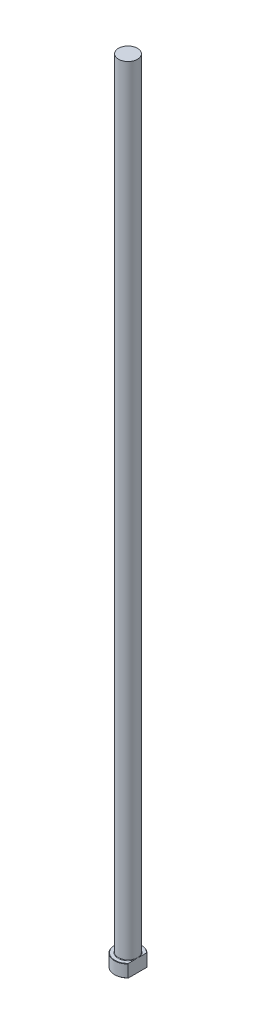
ISO-10303-21;
HEADER;
FILE_DESCRIPTION(('STEP AP214'),'2;1');
FILE_NAME('part.step','',(''),(''),'','','');
FILE_SCHEMA(('AUTOMOTIVE_DESIGN { 1 0 10303 214 1 1 1 1 }'));
ENDSEC;
DATA;
#1=APPLICATION_CONTEXT('core data for automotive mechanical design processes');
#2=APPLICATION_PROTOCOL_DEFINITION('international standard','automotive_design',2000,#1);
#3=PRODUCT_CONTEXT('',#1,'mechanical');
#4=PRODUCT('Part','Part','',(#3));
#5=PRODUCT_RELATED_PRODUCT_CATEGORY('part','',(#4));
#6=PRODUCT_DEFINITION_FORMATION('','',#4);
#7=PRODUCT_DEFINITION_CONTEXT('part definition',#1,'design');
#8=PRODUCT_DEFINITION('design','',#6,#7);
#9=PRODUCT_DEFINITION_SHAPE('','',#8);
#10=(LENGTH_UNIT() NAMED_UNIT(*) SI_UNIT(.MILLI.,.METRE.));
#11=(NAMED_UNIT(*) PLANE_ANGLE_UNIT() SI_UNIT($,.RADIAN.));
#12=(NAMED_UNIT(*) SI_UNIT($,.STERADIAN.) SOLID_ANGLE_UNIT());
#13=UNCERTAINTY_MEASURE_WITH_UNIT(LENGTH_MEASURE(1.E-05),#10,'distance_accuracy_value','');
#14=(GEOMETRIC_REPRESENTATION_CONTEXT(3) GLOBAL_UNCERTAINTY_ASSIGNED_CONTEXT((#13)) GLOBAL_UNIT_ASSIGNED_CONTEXT((#10,
#11,#12)) REPRESENTATION_CONTEXT('',''));
#15=CARTESIAN_POINT('',(0.,0.,0.));
#16=DIRECTION('',(0.,0.,1.));
#17=DIRECTION('',(1.,0.,0.));
#18=AXIS2_PLACEMENT_3D('',#15,#16,#17);
#19=CARTESIAN_POINT('',(0.,0.,0.));
#20=DIRECTION('',(0.,-1.,0.));
#21=DIRECTION('',(0.,0.,-1.));
#22=AXIS2_PLACEMENT_3D('',#19,#20,#21);
#23=PLANE('',#22);
#24=CARTESIAN_POINT('',(0.,0.,0.));
#25=DIRECTION('',(0.,-1.,0.));
#26=DIRECTION('',(0.,0.,-1.));
#27=AXIS2_PLACEMENT_3D('',#24,#25,#26);
#28=CIRCLE('',#27,8.29999999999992);
#29=CARTESIAN_POINT('',(5.99999999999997,0.,5.73498038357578));
#30=VERTEX_POINT('',#29);
#31=CARTESIAN_POINT('',(5.99999999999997,0.,-5.73498038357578));
#32=VERTEX_POINT('',#31);
#33=EDGE_CURVE('E98',#30,#32,#28,.T.);
#34=ORIENTED_EDGE('',*,*,#33,.T.);
#35=DIRECTION('',(0.,0.,1.));
#36=VECTOR('',#35,1.);
#37=CARTESIAN_POINT('',(5.99999999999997,0.,6.02079728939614));
#38=LINE('',#37,#36);
#39=EDGE_CURVE('E83',#32,#30,#38,.T.);
#40=ORIENTED_EDGE('',*,*,#39,.T.);
#41=EDGE_LOOP('',(#34,#40));
#42=FACE_BOUND('',#41,.T.);
#43=ADVANCED_FACE('F32',(#42),#23,.T.);
#44=CARTESIAN_POINT('',(0.,259.958771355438,0.));
#45=DIRECTION('',(0.,1.,0.));
#46=DIRECTION('',(0.,0.,1.));
#47=AXIS2_PLACEMENT_3D('',#44,#45,#46);
#48=CYLINDRICAL_SURFACE('',#47,8.49999999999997);
#49=CARTESIAN_POINT('',(0.,7.80000000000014,0.));
#50=DIRECTION('',(0.,1.,0.));
#51=DIRECTION('',(0.,0.,1.));
#52=AXIS2_PLACEMENT_3D('',#49,#50,#51);
#53=CIRCLE('',#52,8.49999999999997);
#54=CARTESIAN_POINT('',(5.99999999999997,7.80000000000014,6.02079728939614));
#55=VERTEX_POINT('',#54);
#56=CARTESIAN_POINT('',(5.99999999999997,7.80000000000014,-6.02079728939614));
#57=VERTEX_POINT('',#56);
#58=EDGE_CURVE('E104',#55,#57,#53,.F.);
#59=ORIENTED_EDGE('',*,*,#58,.T.);
#60=DIRECTION('',(0.,-1.,0.));
#61=VECTOR('',#60,1.);
#62=CARTESIAN_POINT('',(5.99999999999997,500.,-6.02079728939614));
#63=LINE('',#62,#61);
#64=CARTESIAN_POINT('',(5.99999999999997,0.200000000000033,-6.02079728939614));
#65=VERTEX_POINT('',#64);
#66=EDGE_CURVE('E183',#57,#65,#63,.T.);
#67=ORIENTED_EDGE('',*,*,#66,.T.);
#68=CARTESIAN_POINT('',(0.,0.200000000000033,0.));
#69=DIRECTION('',(0.,-1.,0.));
#70=DIRECTION('',(0.,0.,-1.));
#71=AXIS2_PLACEMENT_3D('',#68,#69,#70);
#72=CIRCLE('',#71,8.49999999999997);
#73=CARTESIAN_POINT('',(5.99999999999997,0.200000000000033,6.02079728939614));
#74=VERTEX_POINT('',#73);
#75=EDGE_CURVE('E100',#65,#74,#72,.F.);
#76=ORIENTED_EDGE('',*,*,#75,.T.);
#77=DIRECTION('',(0.,-1.,0.));
#78=VECTOR('',#77,1.);
#79=CARTESIAN_POINT('',(5.99999999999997,500.,6.02079728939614));
#80=LINE('',#79,#78);
#81=EDGE_CURVE('E93',#55,#74,#80,.T.);
#82=ORIENTED_EDGE('',*,*,#81,.F.);
#83=EDGE_LOOP('',(#59,#67,#76,#82));
#84=FACE_BOUND('',#83,.T.);
#85=ADVANCED_FACE('F158',(#84),#48,.T.);
#86=CARTESIAN_POINT('',(-8.49999999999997,8.,0.));
#87=DIRECTION('',(0.,1.,0.));
#88=DIRECTION('',(0.,0.,1.));
#89=AXIS2_PLACEMENT_3D('',#86,#87,#88);
#90=PLANE('',#89);
#91=CARTESIAN_POINT('',(0.,8.,0.));
#92=DIRECTION('',(0.,1.,0.));
#93=DIRECTION('',(0.,0.,1.));
#94=AXIS2_PLACEMENT_3D('',#91,#92,#93);
#95=CIRCLE('',#94,8.30000000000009);
#96=CARTESIAN_POINT('',(5.99999999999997,8.,-5.73498038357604));
#97=VERTEX_POINT('',#96);
#98=CARTESIAN_POINT('',(5.99999999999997,8.,5.73498038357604));
#99=VERTEX_POINT('',#98);
#100=EDGE_CURVE('E178',#97,#99,#95,.T.);
#101=ORIENTED_EDGE('',*,*,#100,.T.);
#102=DIRECTION('',(0.,0.,-1.));
#103=VECTOR('',#102,1.);
#104=CARTESIAN_POINT('',(5.99999999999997,8.,0.));
#105=LINE('',#104,#103);
#106=CARTESIAN_POINT('',(5.99999999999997,7.99999999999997,1.92093727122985));
#107=VERTEX_POINT('',#106);
#108=EDGE_CURVE('E57',#99,#107,#105,.T.);
#109=ORIENTED_EDGE('',*,*,#108,.T.);
#110=CARTESIAN_POINT('',(0.,8.,0.));
#111=DIRECTION('',(0.,1.,0.));
#112=DIRECTION('',(0.,0.,1.));
#113=AXIS2_PLACEMENT_3D('',#110,#111,#112);
#114=CIRCLE('',#113,6.29999999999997);
#115=CARTESIAN_POINT('',(5.99999999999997,7.99999999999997,-1.92093727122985));
#116=VERTEX_POINT('',#115);
#117=EDGE_CURVE('E107',#107,#116,#114,.F.);
#118=ORIENTED_EDGE('',*,*,#117,.T.);
#119=EDGE_CURVE('E136',#116,#97,#105,.T.);
#120=ORIENTED_EDGE('',*,*,#119,.T.);
#121=EDGE_LOOP('',(#101,#109,#118,#120));
#122=FACE_BOUND('',#121,.T.);
#123=ADVANCED_FACE('F147',(#122),#90,.T.);
#124=CARTESIAN_POINT('',(0.,8.00000000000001,0.));
#125=DIRECTION('',(0.,-1.,0.));
#126=DIRECTION('',(0.,0.,-1.));
#127=AXIS2_PLACEMENT_3D('',#124,#125,#126);
#128=CONICAL_SURFACE('',#127,8.30000000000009,0.785398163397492);
#129=ORIENTED_EDGE('',*,*,#58,.F.);
#130=CARTESIAN_POINT('',(5.99999999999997,1.75758968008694,13.2469505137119));
#131=CARTESIAN_POINT('',(5.99999999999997,1.93438223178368,13.0528651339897));
#132=CARTESIAN_POINT('',(5.99999999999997,2.1108173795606,12.8584542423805));
#133=CARTESIAN_POINT('',(5.99999999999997,2.46286810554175,12.4688887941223));
#134=CARTESIAN_POINT('',(5.99999999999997,2.63848367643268,12.2737342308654));
#135=CARTESIAN_POINT('',(5.99999999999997,3.16402789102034,11.6869221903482));
#136=CARTESIAN_POINT('',(5.99999999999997,3.512564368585,11.2940145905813));
#137=CARTESIAN_POINT('',(5.99999999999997,4.20737297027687,10.5008820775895));
#138=CARTESIAN_POINT('',(5.99999999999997,4.55360756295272,10.1006242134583));
#139=CARTESIAN_POINT('',(5.99999999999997,5.23924501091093,9.29437446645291));
#140=CARTESIAN_POINT('',(5.99999999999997,5.57864880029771,8.88838338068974));
#141=CARTESIAN_POINT('',(5.99999999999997,6.20014365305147,8.12701556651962));
#142=CARTESIAN_POINT('',(5.99999999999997,6.48350363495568,7.77268056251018));
#143=CARTESIAN_POINT('',(5.99999999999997,6.90118479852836,7.23535305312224));
#144=CARTESIAN_POINT('',(5.99999999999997,7.03920968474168,7.05523994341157));
#145=CARTESIAN_POINT('',(5.99999999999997,7.31228512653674,6.69277597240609));
#146=CARTESIAN_POINT('',(5.99999999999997,7.44733576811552,6.51042517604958));
#147=CARTESIAN_POINT('',(5.99999999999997,7.71365491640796,6.14339029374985));
#148=CARTESIAN_POINT('',(5.99999999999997,7.84492875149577,5.95871008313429));
#149=CARTESIAN_POINT('',(5.99999999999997,8.1031071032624,5.58632824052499));
#150=CARTESIAN_POINT('',(5.99999999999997,8.23001189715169,5.3986268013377));
#151=CARTESIAN_POINT('',(5.99999999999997,8.47838103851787,5.01977879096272));
#152=CARTESIAN_POINT('',(5.99999999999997,8.59984807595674,4.82863399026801));
#153=CARTESIAN_POINT('',(5.99999999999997,8.83606873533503,4.44225695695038));
#154=CARTESIAN_POINT('',(5.99999999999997,8.95082335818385,4.24702533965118));
#155=CARTESIAN_POINT('',(5.99999999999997,9.16834438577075,3.85819092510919));
#156=CARTESIAN_POINT('',(5.99999999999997,9.27137801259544,3.66473854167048));
#157=CARTESIAN_POINT('',(5.99999999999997,9.467540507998,3.27281000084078));
#158=CARTESIAN_POINT('',(5.99999999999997,9.56066848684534,3.07433339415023));
#159=CARTESIAN_POINT('',(5.99999999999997,9.73431152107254,2.67227927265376));
#160=CARTESIAN_POINT('',(5.99999999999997,9.81484758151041,2.46871092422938));
#161=CARTESIAN_POINT('',(5.99999999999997,9.96042306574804,2.05607448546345));
#162=CARTESIAN_POINT('',(5.99999999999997,10.0254667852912,1.84700793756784));
#163=CARTESIAN_POINT('',(5.99999999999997,10.1264114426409,1.46315432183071));
#164=CARTESIAN_POINT('',(5.99999999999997,10.1654805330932,1.28920535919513));
#165=CARTESIAN_POINT('',(5.99999999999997,10.2294553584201,0.938706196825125));
#166=CARTESIAN_POINT('',(5.99999999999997,10.2543631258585,0.762156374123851));
#167=CARTESIAN_POINT('',(5.99999999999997,10.2887297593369,0.407890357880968));
#168=CARTESIAN_POINT('',(5.99999999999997,10.2982190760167,0.230177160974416));
#169=CARTESIAN_POINT('',(5.99999999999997,10.301323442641,-0.12539280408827));
#170=CARTESIAN_POINT('',(5.99999999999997,10.2949382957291,-0.303249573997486));
#171=CARTESIAN_POINT('',(5.99999999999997,10.2666831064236,-0.657249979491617));
#172=CARTESIAN_POINT('',(5.99999999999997,10.2448527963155,-0.833396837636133));
#173=CARTESIAN_POINT('',(5.99999999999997,10.1868620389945,-1.18332422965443));
#174=CARTESIAN_POINT('',(5.99999999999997,10.1506981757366,-1.35710418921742));
#175=CARTESIAN_POINT('',(5.99999999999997,10.0655340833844,-1.70193222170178));
#176=CARTESIAN_POINT('',(5.99999999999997,10.0165006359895,-1.87297199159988));
#177=CARTESIAN_POINT('',(5.99999999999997,9.9074370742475,-2.21145638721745));
#178=CARTESIAN_POINT('',(5.99999999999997,9.84740753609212,-2.37890120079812));
#179=CARTESIAN_POINT('',(5.99999999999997,9.69449933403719,-2.77055604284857));
#180=CARTESIAN_POINT('',(5.99999999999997,9.59762441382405,-2.99320000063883));
#181=CARTESIAN_POINT('',(5.99999999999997,9.39041412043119,-3.43217897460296));
#182=CARTESIAN_POINT('',(5.99999999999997,9.28007160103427,-3.64851056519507));
#183=CARTESIAN_POINT('',(5.99999999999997,9.04872697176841,-4.07594347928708));
#184=CARTESIAN_POINT('',(5.99999999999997,8.92770286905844,-4.28703280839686));
#185=CARTESIAN_POINT('',(5.99999999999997,8.677524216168,-4.70425268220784));
#186=CARTESIAN_POINT('',(5.99999999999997,8.54837109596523,-4.91038409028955));
#187=CARTESIAN_POINT('',(5.99999999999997,8.28223284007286,-5.32064004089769));
#188=CARTESIAN_POINT('',(5.99999999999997,8.14517883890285,-5.52471970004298));
#189=CARTESIAN_POINT('',(5.99999999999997,7.86585169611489,-5.92927121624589));
#190=CARTESIAN_POINT('',(5.99999999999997,7.72357838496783,-6.12974295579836));
#191=CARTESIAN_POINT('',(5.99999999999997,7.4350057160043,-6.52738897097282));
#192=CARTESIAN_POINT('',(5.99999999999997,7.28871143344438,-6.72456694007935));
#193=CARTESIAN_POINT('',(5.99999999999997,6.99270011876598,-7.11633919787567));
#194=CARTESIAN_POINT('',(5.99999999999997,6.84298299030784,-7.3109334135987));
#195=CARTESIAN_POINT('',(5.99999999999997,6.49456418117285,-7.75702816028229));
#196=CARTESIAN_POINT('',(5.99999999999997,6.29487025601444,-8.00775292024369));
#197=CARTESIAN_POINT('',(5.99999999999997,5.89169138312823,-8.50613413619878));
#198=CARTESIAN_POINT('',(5.99999999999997,5.68820636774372,-8.7537905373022));
#199=CARTESIAN_POINT('',(5.99999999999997,5.27809760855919,-9.24667622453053));
#200=CARTESIAN_POINT('',(5.99999999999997,5.07147248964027,-9.4919043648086));
#201=CARTESIAN_POINT('',(5.99999999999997,4.65573644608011,-9.98024423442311));
#202=CARTESIAN_POINT('',(5.99999999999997,4.4466255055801,-10.2233559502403));
#203=CARTESIAN_POINT('',(5.99999999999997,4.03294810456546,-10.7001949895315));
#204=CARTESIAN_POINT('',(5.99999999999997,3.82844502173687,-10.9339773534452));
#205=CARTESIAN_POINT('',(5.99999999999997,3.4178211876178,-11.4001180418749));
#206=CARTESIAN_POINT('',(5.99999999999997,3.21170042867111,-11.6324763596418));
#207=CARTESIAN_POINT('',(5.99999999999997,2.79824862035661,-12.0957939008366));
#208=CARTESIAN_POINT('',(5.99999999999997,2.59091861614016,-12.3267540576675));
#209=CARTESIAN_POINT('',(5.99999999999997,2.17508648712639,-12.7876097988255));
#210=CARTESIAN_POINT('',(5.99999999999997,1.96658438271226,-13.0175054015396));
#211=CARTESIAN_POINT('',(5.99999999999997,1.75758968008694,-13.2469505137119));
#212=B_SPLINE_CURVE_WITH_KNOTS('',3,(#130,#131,#132,#133,#134,#135,#136,#137,#138,#139,#140,
#141,#142,#143,#144,#145,#146,#147,#148,#149,#150,#151,#152,#153,#154,#155,#156,#157,#158,#159,
#160,#161,#162,#163,#164,#165,#166,#167,#168,#169,#170,#171,#172,#173,#174,#175,#176,#177,#178,
#179,#180,#181,#182,#183,#184,#185,#186,#187,#188,#189,#190,#191,#192,#193,#194,#195,#196,#197,
#198,#199,#200,#201,#202,#203,#204,#205,#206,#207,#208,#209,#210,#211),.UNSPECIFIED.,.F.,.F.,(4,
2,2,2,2,2,2,2,2,2,2,2,2,2,2,2,2,2,2,2,2,2,2,2,2,2,2,2,2,2,2,2,2,2,2,2,2,2,2,2,4),(0.,
0.78760481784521,1.57521665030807,3.15083930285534,4.73847641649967,6.32589492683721,
7.68685989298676,8.36758868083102,9.04829776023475,9.72799402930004,10.4076470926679,
11.0869601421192,11.7661716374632,12.4234853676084,13.0808580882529,13.7371222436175,
14.3932042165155,14.9275387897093,15.4617966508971,15.9949980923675,16.5282061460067,
17.0600474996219,17.5920156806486,18.1253706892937,18.6586977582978,19.3865060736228,
20.1147022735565,20.8444344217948,21.5740385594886,22.3114278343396,23.0488410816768,
23.7853628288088,24.5219053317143,25.4834511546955,26.4450141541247,27.4070111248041,
28.3690142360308,29.3008217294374,30.2326336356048,31.1637335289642,32.094817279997),.UNSPECIFIED.);
#213=EDGE_CURVE('E135',#55,#99,#212,.T.);
#214=ORIENTED_EDGE('',*,*,#213,.T.);
#215=ORIENTED_EDGE('',*,*,#100,.F.);
#216=EDGE_CURVE('E127',#97,#57,#212,.T.);
#217=ORIENTED_EDGE('',*,*,#216,.T.);
#218=EDGE_LOOP('',(#129,#214,#215,#217));
#219=FACE_BOUND('',#218,.T.);
#220=ADVANCED_FACE('F143',(#219),#128,.T.);
#221=CARTESIAN_POINT('',(0.,0.200000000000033,0.));
#222=DIRECTION('',(0.,1.,0.));
#223=DIRECTION('',(0.,0.,1.));
#224=AXIS2_PLACEMENT_3D('',#221,#222,#223);
#225=CONICAL_SURFACE('',#224,8.49999999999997,0.785398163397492);
#226=ORIENTED_EDGE('',*,*,#75,.F.);
#227=CARTESIAN_POINT('',(5.99999999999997,6.24241031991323,-13.2469505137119));
#228=CARTESIAN_POINT('',(5.99999999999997,6.06561776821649,-13.0528651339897));
#229=CARTESIAN_POINT('',(5.99999999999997,5.88918262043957,-12.8584542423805));
#230=CARTESIAN_POINT('',(5.99999999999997,5.53713189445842,-12.4688887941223));
#231=CARTESIAN_POINT('',(5.99999999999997,5.36151632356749,-12.2737342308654));
#232=CARTESIAN_POINT('',(5.99999999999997,4.83597210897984,-11.6869221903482));
#233=CARTESIAN_POINT('',(5.99999999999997,4.48743563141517,-11.2940145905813));
#234=CARTESIAN_POINT('',(5.99999999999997,3.7926270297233,-10.5008820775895));
#235=CARTESIAN_POINT('',(5.99999999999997,3.44639243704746,-10.1006242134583));
#236=CARTESIAN_POINT('',(5.99999999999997,2.76075498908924,-9.29437446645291));
#237=CARTESIAN_POINT('',(5.99999999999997,2.42135119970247,-8.88838338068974));
#238=CARTESIAN_POINT('',(5.99999999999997,1.79985634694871,-8.12701556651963));
#239=CARTESIAN_POINT('',(5.99999999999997,1.5164963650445,-7.77268056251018));
#240=CARTESIAN_POINT('',(5.99999999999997,1.09881520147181,-7.23535305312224));
#241=CARTESIAN_POINT('',(5.99999999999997,0.960790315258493,-7.05523994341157));
#242=CARTESIAN_POINT('',(5.99999999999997,0.687714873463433,-6.69277597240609));
#243=CARTESIAN_POINT('',(5.99999999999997,0.552664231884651,-6.51042517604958));
#244=CARTESIAN_POINT('',(5.99999999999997,0.286345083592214,-6.14339029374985));
#245=CARTESIAN_POINT('',(5.99999999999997,0.155071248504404,-5.95871008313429));
#246=CARTESIAN_POINT('',(5.99999999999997,-0.103107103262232,-5.58632824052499));
#247=CARTESIAN_POINT('',(5.99999999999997,-0.230011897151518,-5.3986268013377));
#248=CARTESIAN_POINT('',(5.99999999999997,-0.478381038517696,-5.01977879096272));
#249=CARTESIAN_POINT('',(5.99999999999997,-0.599848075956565,-4.82863399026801));
#250=CARTESIAN_POINT('',(5.99999999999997,-0.836068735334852,-4.44225695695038));
#251=CARTESIAN_POINT('',(5.99999999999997,-0.950823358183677,-4.24702533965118));
#252=CARTESIAN_POINT('',(5.99999999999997,-1.16834438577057,-3.85819092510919));
#253=CARTESIAN_POINT('',(5.99999999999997,-1.27137801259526,-3.66473854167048));
#254=CARTESIAN_POINT('',(5.99999999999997,-1.46754050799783,-3.27281000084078));
#255=CARTESIAN_POINT('',(5.99999999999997,-1.56066848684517,-3.07433339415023));
#256=CARTESIAN_POINT('',(5.99999999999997,-1.73431152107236,-2.67227927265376));
#257=CARTESIAN_POINT('',(5.99999999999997,-1.81484758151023,-2.46871092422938));
#258=CARTESIAN_POINT('',(5.99999999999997,-1.96042306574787,-2.05607448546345));
#259=CARTESIAN_POINT('',(5.99999999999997,-2.02546678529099,-1.84700793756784));
#260=CARTESIAN_POINT('',(5.99999999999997,-2.1264114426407,-1.46315432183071));
#261=CARTESIAN_POINT('',(5.99999999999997,-2.16548053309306,-1.28920535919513));
#262=CARTESIAN_POINT('',(5.99999999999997,-2.22945535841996,-0.938706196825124));
#263=CARTESIAN_POINT('',(5.99999999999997,-2.25436312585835,-0.762156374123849));
#264=CARTESIAN_POINT('',(5.99999999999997,-2.28872975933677,-0.407890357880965));
#265=CARTESIAN_POINT('',(5.99999999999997,-2.29821907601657,-0.230177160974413));
#266=CARTESIAN_POINT('',(5.99999999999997,-2.30132344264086,0.125392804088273));
#267=CARTESIAN_POINT('',(5.99999999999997,-2.29493829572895,0.303249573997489));
#268=CARTESIAN_POINT('',(5.99999999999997,-2.26668310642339,0.657249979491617));
#269=CARTESIAN_POINT('',(5.99999999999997,-2.24485279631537,0.833396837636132));
#270=CARTESIAN_POINT('',(5.99999999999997,-2.18686203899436,1.18332422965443));
#271=CARTESIAN_POINT('',(5.99999999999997,-2.15069817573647,1.35710418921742));
#272=CARTESIAN_POINT('',(5.99999999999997,-2.06553408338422,1.70193222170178));
#273=CARTESIAN_POINT('',(5.99999999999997,-2.01650063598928,1.87297199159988));
#274=CARTESIAN_POINT('',(5.99999999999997,-1.90743707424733,2.21145638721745));
#275=CARTESIAN_POINT('',(5.99999999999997,-1.84740753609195,2.37890120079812));
#276=CARTESIAN_POINT('',(5.99999999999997,-1.69449933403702,2.77055604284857));
#277=CARTESIAN_POINT('',(5.99999999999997,-1.59762441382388,2.99320000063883));
#278=CARTESIAN_POINT('',(5.99999999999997,-1.39041412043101,3.43217897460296));
#279=CARTESIAN_POINT('',(5.99999999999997,-1.2800716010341,3.64851056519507));
#280=CARTESIAN_POINT('',(5.99999999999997,-1.04872697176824,4.07594347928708));
#281=CARTESIAN_POINT('',(5.99999999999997,-0.927702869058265,4.28703280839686));
#282=CARTESIAN_POINT('',(5.99999999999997,-0.677524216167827,4.70425268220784));
#283=CARTESIAN_POINT('',(5.99999999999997,-0.54837109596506,4.91038409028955));
#284=CARTESIAN_POINT('',(5.99999999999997,-0.282232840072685,5.32064004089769));
#285=CARTESIAN_POINT('',(5.99999999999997,-0.145178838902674,5.52471970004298));
#286=CARTESIAN_POINT('',(5.99999999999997,0.134148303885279,5.92927121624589));
#287=CARTESIAN_POINT('',(5.99999999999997,0.276421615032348,6.12974295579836));
#288=CARTESIAN_POINT('',(5.99999999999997,0.564994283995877,6.52738897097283));
#289=CARTESIAN_POINT('',(5.99999999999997,0.71128856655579,6.72456694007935));
#290=CARTESIAN_POINT('',(5.99999999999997,1.00729988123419,7.11633919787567));
#291=CARTESIAN_POINT('',(5.99999999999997,1.15701700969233,7.3109334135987));
#292=CARTESIAN_POINT('',(5.99999999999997,1.50543581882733,7.75702816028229));
#293=CARTESIAN_POINT('',(5.99999999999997,1.70512974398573,8.00775292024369));
#294=CARTESIAN_POINT('',(5.99999999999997,2.10830861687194,8.50613413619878));
#295=CARTESIAN_POINT('',(5.99999999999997,2.31179363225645,8.7537905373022));
#296=CARTESIAN_POINT('',(5.99999999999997,2.72190239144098,9.24667622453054));
#297=CARTESIAN_POINT('',(5.99999999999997,2.92852751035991,9.4919043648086));
#298=CARTESIAN_POINT('',(5.99999999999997,3.34426355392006,9.98024423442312));
#299=CARTESIAN_POINT('',(5.99999999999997,3.55337449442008,10.2233559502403));
#300=CARTESIAN_POINT('',(5.99999999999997,3.96705189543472,10.7001949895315));
#301=CARTESIAN_POINT('',(5.99999999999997,4.17155497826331,10.9339773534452));
#302=CARTESIAN_POINT('',(5.99999999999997,4.58217881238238,11.4001180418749));
#303=CARTESIAN_POINT('',(5.99999999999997,4.78829957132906,11.6324763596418));
#304=CARTESIAN_POINT('',(5.99999999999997,5.20175137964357,12.0957939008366));
#305=CARTESIAN_POINT('',(5.99999999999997,5.40908138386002,12.3267540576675));
#306=CARTESIAN_POINT('',(5.99999999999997,5.82491351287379,12.7876097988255));
#307=CARTESIAN_POINT('',(5.99999999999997,6.03341561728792,13.0175054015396));
#308=CARTESIAN_POINT('',(5.99999999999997,6.24241031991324,13.2469505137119));
#309=B_SPLINE_CURVE_WITH_KNOTS('',3,(#227,#228,#229,#230,#231,#232,#233,#234,#235,#236,#237,
#238,#239,#240,#241,#242,#243,#244,#245,#246,#247,#248,#249,#250,#251,#252,#253,#254,#255,#256,
#257,#258,#259,#260,#261,#262,#263,#264,#265,#266,#267,#268,#269,#270,#271,#272,#273,#274,#275,
#276,#277,#278,#279,#280,#281,#282,#283,#284,#285,#286,#287,#288,#289,#290,#291,#292,#293,#294,
#295,#296,#297,#298,#299,#300,#301,#302,#303,#304,#305,#306,#307,#308),.UNSPECIFIED.,.F.,.F.,(4,
2,2,2,2,2,2,2,2,2,2,2,2,2,2,2,2,2,2,2,2,2,2,2,2,2,2,2,2,2,2,2,2,2,2,2,2,2,2,2,4),(0.,
0.787604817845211,1.57521665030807,3.15083930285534,4.73847641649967,6.32589492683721,
7.68685989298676,8.36758868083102,9.04829776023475,9.72799402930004,10.4076470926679,
11.0869601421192,11.7661716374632,12.4234853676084,13.0808580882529,13.7371222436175,
14.3932042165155,14.9275387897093,15.4617966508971,15.9949980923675,16.5282061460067,
17.0600474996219,17.5920156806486,18.1253706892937,18.6586977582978,19.3865060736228,
20.1147022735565,20.8444344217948,21.5740385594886,22.3114278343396,23.0488410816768,
23.7853628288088,24.5219053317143,25.4834511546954,26.4450141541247,27.4070111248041,
28.3690142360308,29.3008217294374,30.2326336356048,31.1637335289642,32.0948172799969),.UNSPECIFIED.);
#310=EDGE_CURVE('E86',#65,#32,#309,.T.);
#311=ORIENTED_EDGE('',*,*,#310,.T.);
#312=ORIENTED_EDGE('',*,*,#33,.F.);
#313=EDGE_CURVE('E89',#30,#74,#309,.T.);
#314=ORIENTED_EDGE('',*,*,#313,.T.);
#315=EDGE_LOOP('',(#226,#311,#312,#314));
#316=FACE_BOUND('',#315,.T.);
#317=ADVANCED_FACE('F97',(#316),#225,.T.);
#318=CARTESIAN_POINT('',(0.,8.29999999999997,0.));
#319=DIRECTION('',(0.,1.,0.));
#320=DIRECTION('',(0.,0.,1.));
#321=AXIS2_PLACEMENT_3D('',#318,#319,#320);
#322=TOROIDAL_SURFACE('',#321,6.29999999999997,0.3);
#323=CARTESIAN_POINT('',(5.99999999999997,8.29999999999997,0.));
#324=CARTESIAN_POINT('',(5.99999999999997,8.30000062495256,1.34604190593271E-10));
#325=CARTESIAN_POINT('',(5.99999999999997,8.30000124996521,-2.85495124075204E-07));
#326=CARTESIAN_POINT('',(5.99999999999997,8.30000241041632,-1.04928093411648E-06));
#327=CARTESIAN_POINT('',(5.99999999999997,8.3000029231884,-1.54785174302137E-06));
#328=CARTESIAN_POINT('',(5.99999999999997,8.30000401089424,-2.74944388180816E-06));
#329=CARTESIAN_POINT('',(5.99999999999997,8.30000456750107,-3.47196545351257E-06));
#330=CARTESIAN_POINT('',(5.99999999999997,8.30000554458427,-4.95172589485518E-06));
#331=CARTESIAN_POINT('',(5.99999999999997,8.30000596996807,-5.70604371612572E-06));
#332=CARTESIAN_POINT('',(5.99999999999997,8.30000759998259,-8.69525120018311E-06));
#333=CARTESIAN_POINT('',(5.99999999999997,8.30000872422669,-1.09781829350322E-05));
#334=CARTESIAN_POINT('',(5.99999999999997,8.30001052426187,-1.54456348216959E-05));
#335=CARTESIAN_POINT('',(5.99999999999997,8.30001123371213,-1.7617076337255E-05));
#336=CARTESIAN_POINT('',(5.99999999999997,8.30001429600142,-2.6992812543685E-05));
#337=CARTESIAN_POINT('',(5.99999999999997,8.30001664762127,-3.4200026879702E-05));
#338=CARTESIAN_POINT('',(5.99999999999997,8.30002002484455,-4.76829004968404E-05));
#339=CARTESIAN_POINT('',(5.99999999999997,8.30002120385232,-5.39195612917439E-05));
#340=CARTESIAN_POINT('',(5.99999999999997,8.3000299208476,-0.000100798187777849));
#341=CARTESIAN_POINT('',(5.99999999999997,8.30003667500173,-0.00014152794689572));
#342=CARTESIAN_POINT('',(5.99999999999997,8.30006623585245,-0.000303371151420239));
#343=CARTESIAN_POINT('',(5.99999999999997,8.30009428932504,-0.000423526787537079));
#344=CARTESIAN_POINT('',(5.99999999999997,8.30020425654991,-0.000901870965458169));
#345=CARTESIAN_POINT('',(5.99999999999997,8.30028289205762,-0.00126055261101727));
#346=CARTESIAN_POINT('',(5.99999999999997,8.3005993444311,-0.00269405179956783));
#347=CARTESIAN_POINT('',(5.99999999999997,8.30084137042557,-0.00376821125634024));
#348=CARTESIAN_POINT('',(5.99999999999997,8.30185255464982,-0.0082672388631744));
#349=CARTESIAN_POINT('',(5.99999999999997,8.30261638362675,-0.0116929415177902));
#350=CARTESIAN_POINT('',(5.99999999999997,8.30945824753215,-0.0423635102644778));
#351=CARTESIAN_POINT('',(5.99999999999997,8.31555811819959,-0.0696050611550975));
#352=CARTESIAN_POINT('',(5.99999999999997,8.3274771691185,-0.122985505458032));
#353=CARTESIAN_POINT('',(5.99999999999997,8.33329766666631,-0.149124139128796));
#354=CARTESIAN_POINT('',(5.99999999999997,8.34565922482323,-0.204790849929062));
#355=CARTESIAN_POINT('',(5.99999999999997,8.35219607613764,-0.234319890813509));
#356=CARTESIAN_POINT('',(5.99999999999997,8.36527652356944,-0.293721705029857));
#357=CARTESIAN_POINT('',(5.99999999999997,8.37181938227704,-0.323594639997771));
#358=CARTESIAN_POINT('',(5.99999999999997,8.38741819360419,-0.395325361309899));
#359=CARTESIAN_POINT('',(5.99999999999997,8.39643140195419,-0.437192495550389));
#360=CARTESIAN_POINT('',(5.99999999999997,8.41397520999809,-0.519837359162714));
#361=CARTESIAN_POINT('',(5.99999999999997,8.42251226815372,-0.560613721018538));
#362=CARTESIAN_POINT('',(5.99999999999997,8.45005469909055,-0.694529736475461));
#363=CARTESIAN_POINT('',(5.99999999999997,8.4684527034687,-0.787796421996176));
#364=CARTESIAN_POINT('',(5.99999999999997,8.50309772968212,-0.975673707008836));
#365=CARTESIAN_POINT('',(5.99999999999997,8.51932210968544,-1.07028855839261));
#366=CARTESIAN_POINT('',(5.99999999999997,8.54979671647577,-1.26922112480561));
#367=CARTESIAN_POINT('',(5.99999999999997,8.56370439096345,-1.37359247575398));
#368=CARTESIAN_POINT('',(5.99999999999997,8.58567213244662,-1.58267692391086));
#369=CARTESIAN_POINT('',(5.99999999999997,8.59375049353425,-1.6873879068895));
#370=CARTESIAN_POINT('',(5.99999999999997,8.59943466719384,-1.84308999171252));
#371=CARTESIAN_POINT('',(5.99999999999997,8.60029184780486,-1.89396002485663));
#372=CARTESIAN_POINT('',(5.99999999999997,8.5995288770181,-1.99574511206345));
#373=CARTESIAN_POINT('',(5.99999999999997,8.59790613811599,-2.04666015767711));
#374=CARTESIAN_POINT('',(5.99999999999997,8.59158346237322,-2.14740525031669));
#375=CARTESIAN_POINT('',(5.99999999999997,8.58693864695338,-2.1972385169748));
#376=CARTESIAN_POINT('',(5.99999999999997,8.57369485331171,-2.29634018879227));
#377=CARTESIAN_POINT('',(5.99999999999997,8.56510170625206,-2.34560931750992));
#378=CARTESIAN_POINT('',(5.99999999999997,8.54513600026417,-2.43101613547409));
#379=CARTESIAN_POINT('',(5.99999999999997,8.53495732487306,-2.46741817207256));
#380=CARTESIAN_POINT('',(5.99999999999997,8.5163599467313,-2.52083307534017));
#381=CARTESIAN_POINT('',(5.99999999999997,8.50961541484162,-2.53842082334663));
#382=CARTESIAN_POINT('',(5.99999999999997,8.49476050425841,-2.57300282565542));
#383=CARTESIAN_POINT('',(5.99999999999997,8.48665036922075,-2.58999718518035));
#384=CARTESIAN_POINT('',(5.99999999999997,8.4656679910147,-2.62872971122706));
#385=CARTESIAN_POINT('',(5.99999999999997,8.45211281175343,-2.65012863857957));
#386=CARTESIAN_POINT('',(5.99999999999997,8.42848584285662,-2.67978235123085));
#387=CARTESIAN_POINT('',(5.99999999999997,8.42001211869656,-2.68929941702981));
#388=CARTESIAN_POINT('',(5.99999999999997,8.40175979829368,-2.70700164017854));
#389=CARTESIAN_POINT('',(5.99999999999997,8.3919842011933,-2.71518976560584));
#390=CARTESIAN_POINT('',(5.99999999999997,8.37475773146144,-2.72695700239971));
#391=CARTESIAN_POINT('',(5.99999999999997,8.36772137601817,-2.73113834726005));
#392=CARTESIAN_POINT('',(5.99999999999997,8.35309194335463,-2.73838811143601));
#393=CARTESIAN_POINT('',(5.99999999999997,8.34549938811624,-2.7414575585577));
#394=CARTESIAN_POINT('',(5.99999999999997,8.32979919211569,-2.74623687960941));
#395=CARTESIAN_POINT('',(5.99999999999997,8.32168697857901,-2.74793213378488));
#396=CARTESIAN_POINT('',(5.99999999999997,8.30528814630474,-2.74970225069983));
#397=CARTESIAN_POINT('',(5.99999999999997,8.29700168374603,-2.74977850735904));
#398=CARTESIAN_POINT('',(5.99999999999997,8.2816016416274,-2.74839814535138));
#399=CARTESIAN_POINT('',(5.99999999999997,8.27447007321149,-2.74713049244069));
#400=CARTESIAN_POINT('',(5.99999999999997,8.26050316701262,-2.74347158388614));
#401=CARTESIAN_POINT('',(5.99999999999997,8.25366802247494,-2.7410796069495));
#402=CARTESIAN_POINT('',(5.99999999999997,8.23783277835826,-2.73423902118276));
#403=CARTESIAN_POINT('',(5.99999999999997,8.22902314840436,-2.72935244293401));
#404=CARTESIAN_POINT('',(5.99999999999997,8.21228574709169,-2.7182516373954));
#405=CARTESIAN_POINT('',(5.99999999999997,8.20436026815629,-2.71203407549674));
#406=CARTESIAN_POINT('',(5.99999999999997,8.18433696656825,-2.69420240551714));
#407=CARTESIAN_POINT('',(5.99999999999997,8.17298706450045,-2.68175715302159));
#408=CARTESIAN_POINT('',(5.99999999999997,8.15219498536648,-2.65539556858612));
#409=CARTESIAN_POINT('',(5.99999999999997,8.14275658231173,-2.64147640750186));
#410=CARTESIAN_POINT('',(5.99999999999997,8.12508934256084,-2.61223187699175));
#411=CARTESIAN_POINT('',(5.99999999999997,8.11691464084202,-2.59687428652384));
#412=CARTESIAN_POINT('',(5.99999999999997,8.10186133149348,-2.56552911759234));
#413=CARTESIAN_POINT('',(5.99999999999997,8.09498416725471,-2.54954086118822));
#414=CARTESIAN_POINT('',(5.99999999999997,8.07586257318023,-2.50075322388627));
#415=CARTESIAN_POINT('',(5.99999999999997,8.06523495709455,-2.46732486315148));
#416=CARTESIAN_POINT('',(5.99999999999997,8.04175411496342,-2.38014114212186));
#417=CARTESIAN_POINT('',(5.99999999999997,8.0311656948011,-2.32580591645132));
#418=CARTESIAN_POINT('',(5.99999999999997,8.01502027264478,-2.21628778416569));
#419=CARTESIAN_POINT('',(5.99999999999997,8.00947977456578,-2.16110269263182));
#420=CARTESIAN_POINT('',(5.99999999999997,8.00227593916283,-2.05225433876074));
#421=CARTESIAN_POINT('',(5.99999999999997,8.00049528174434,-1.99859827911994));
#422=CARTESIAN_POINT('',(5.99999999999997,7.99968738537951,-1.89155586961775));
#423=CARTESIAN_POINT('',(5.99999999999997,8.00064591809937,-1.8381695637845));
#424=CARTESIAN_POINT('',(5.99999999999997,8.00516082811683,-1.72092619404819));
#425=CARTESIAN_POINT('',(5.99999999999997,8.0091939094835,-1.65708843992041));
#426=CARTESIAN_POINT('',(5.99999999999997,8.01973827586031,-1.52965474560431));
#427=CARTESIAN_POINT('',(5.99999999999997,8.02624848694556,-1.46605871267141));
#428=CARTESIAN_POINT('',(5.99999999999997,8.04143114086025,-1.33760082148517));
#429=CARTESIAN_POINT('',(5.99999999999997,8.05015116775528,-1.27274468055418));
#430=CARTESIAN_POINT('',(5.99999999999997,8.06927542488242,-1.14310871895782));
#431=CARTESIAN_POINT('',(5.99999999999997,8.07968406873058,-1.07832955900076));
#432=CARTESIAN_POINT('',(5.99999999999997,8.10594320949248,-0.924890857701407));
#433=CARTESIAN_POINT('',(5.99999999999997,8.12237584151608,-0.83633166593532));
#434=CARTESIAN_POINT('',(5.99999999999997,8.15676035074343,-0.660568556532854));
#435=CARTESIAN_POINT('',(5.99999999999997,8.1746926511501,-0.573360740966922));
#436=CARTESIAN_POINT('',(5.99999999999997,8.2094636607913,-0.409309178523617));
#437=CARTESIAN_POINT('',(5.99999999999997,8.22618667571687,-0.332440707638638));
#438=CARTESIAN_POINT('',(5.99999999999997,8.25202386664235,-0.215187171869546));
#439=CARTESIAN_POINT('',(5.99999999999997,8.26098977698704,-0.174768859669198));
#440=CARTESIAN_POINT('',(5.99999999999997,8.27885525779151,-0.0946083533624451));
#441=CARTESIAN_POINT('',(5.99999999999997,8.28775352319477,-0.0548658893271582));
#442=CARTESIAN_POINT('',(5.99999999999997,8.29738533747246,-0.0116849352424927));
#443=CARTESIAN_POINT('',(5.99999999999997,8.29815099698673,-0.00825124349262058));
#444=CARTESIAN_POINT('',(5.99999999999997,8.29916260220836,-0.00375043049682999));
#445=CARTESIAN_POINT('',(5.99999999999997,8.29940322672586,-0.00268247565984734));
#446=CARTESIAN_POINT('',(5.99999999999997,8.29971797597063,-0.00125668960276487));
#447=CARTESIAN_POINT('',(5.99999999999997,8.29979628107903,-0.000899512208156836));
#448=CARTESIAN_POINT('',(5.99999999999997,8.29990585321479,-0.000422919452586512));
#449=CARTESIAN_POINT('',(5.99999999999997,8.29993385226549,-0.000303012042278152));
#450=CARTESIAN_POINT('',(5.99999999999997,8.29996336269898,-0.000141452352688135));
#451=CARTESIAN_POINT('',(5.99999999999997,8.29997011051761,-0.000100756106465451));
#452=CARTESIAN_POINT('',(5.99999999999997,8.29997881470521,-5.39118918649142E-05));
#453=CARTESIAN_POINT('',(5.99999999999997,8.29997999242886,-4.76769650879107E-05));
#454=CARTESIAN_POINT('',(5.99999999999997,8.29998336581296,-3.41977672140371E-05));
#455=CARTESIAN_POINT('',(5.99999999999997,8.29998571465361,-2.69924045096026E-05));
#456=CARTESIAN_POINT('',(5.99999999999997,8.29998877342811,-1.76186230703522E-05));
#457=CARTESIAN_POINT('',(5.99999999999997,8.29998948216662,-1.54473109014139E-05));
#458=CARTESIAN_POINT('',(5.99999999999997,8.29999128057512,-1.09800126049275E-05));
#459=CARTESIAN_POINT('',(5.99999999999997,8.29999240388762,-8.69708716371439E-06));
#460=CARTESIAN_POINT('',(5.99999999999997,8.29999403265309,-5.70776687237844E-06));
#461=CARTESIAN_POINT('',(5.99999999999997,8.29999445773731,-4.95337958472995E-06));
#462=CARTESIAN_POINT('',(5.99999999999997,8.29999543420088,-3.47342614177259E-06));
#463=CARTESIAN_POINT('',(5.99999999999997,8.29999599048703,-2.75077832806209E-06));
#464=CARTESIAN_POINT('',(5.99999999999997,8.29999707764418,-1.54889531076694E-06));
#465=CARTESIAN_POINT('',(5.99999999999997,8.29999759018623,-1.05017220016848E-06));
#466=CARTESIAN_POINT('',(5.99999999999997,8.29999875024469,-2.85992440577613E-07));
#467=CARTESIAN_POINT('',(5.99999999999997,8.29999937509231,-1.34594515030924E-10));
#468=CARTESIAN_POINT('',(5.99999999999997,8.29999999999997,0.));
#469=B_SPLINE_CURVE_WITH_KNOTS('',3,(#323,#324,#325,#326,#327,#328,#329,#330,#331,#332,#333,
#334,#335,#336,#337,#338,#339,#340,#341,#342,#343,#344,#345,#346,#347,#348,#349,#350,#351,#352,
#353,#354,#355,#356,#357,#358,#359,#360,#361,#362,#363,#364,#365,#366,#367,#368,#369,#370,#371,
#372,#373,#374,#375,#376,#377,#378,#379,#380,#381,#382,#383,#384,#385,#386,#387,#388,#389,#390,
#391,#392,#393,#394,#395,#396,#397,#398,#399,#400,#401,#402,#403,#404,#405,#406,#407,#408,#409,
#410,#411,#412,#413,#414,#415,#416,#417,#418,#419,#420,#421,#422,#423,#424,#425,#426,#427,#428,
#429,#430,#431,#432,#433,#434,#435,#436,#437,#438,#439,#440,#441,#442,#443,#444,#445,#446,#447,
#448,#449,#450,#451,#452,#453,#454,#455,#456,#457,#458,#459,#460,#461,#462,#463,#464,#465,#466,
#467,#468),.UNSPECIFIED.,.T.,.F.,(4,2,2,2,2,2,2,2,2,2,2,2,2,2,2,2,2,2,2,2,2,2,2,2,2,2,2,2,2,2,2,
2,2,2,2,2,2,2,2,2,2,2,2,2,2,2,2,2,2,2,2,2,2,2,2,2,2,2,2,2,2,2,2,2,2,2,2,2,2,2,2,2,4),(0.,
1.90630836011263E-06,4.06389249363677E-06,6.78060384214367E-06,9.37792682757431E-06,
1.69875443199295E-05,2.38342809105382E-05,4.65460513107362E-05,6.55661823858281E-05,
0.00018946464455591,0.000559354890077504,0.00166124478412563,0.00496415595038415,
0.0154940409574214,0.0992404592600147,0.179577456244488,0.270309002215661,0.362052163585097,
0.490530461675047,0.61551151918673,0.900684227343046,1.18862836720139,1.50441328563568,
1.81920281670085,1.97178950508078,2.12453550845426,2.27457076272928,2.42438514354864,
2.53755667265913,2.59401506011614,2.65046338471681,2.72600079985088,2.76413970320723,
2.8021922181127,2.82667181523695,2.85112872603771,2.87584253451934,2.90053506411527,
2.92216471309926,2.94380825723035,2.97385970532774,3.00398734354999,3.05423323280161,
3.10457737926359,3.15668997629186,3.20886020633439,3.3138589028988,3.47955406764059,
3.64578904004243,3.8067552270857,3.96688682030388,4.15871791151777,4.35046593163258,
4.54675795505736,4.74357155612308,5.01375693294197,5.28084482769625,5.51684158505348,
5.641044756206,5.7632210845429,5.7737755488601,5.77705938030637,5.77815664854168,
5.77852577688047,5.77864957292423,5.77866858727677,5.77869129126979,5.77869813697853,
5.77870574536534,5.77870834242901,5.77871105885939,5.77871321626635,5.77871512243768),.UNSPECIFIED.);
#470=CARTESIAN_POINT('',(5.99999999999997,8.29999999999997,0.));
#471=VERTEX_POINT('',#470);
#472=EDGE_CURVE('E11',#116,#471,#469,.T.);
#473=ORIENTED_EDGE('',*,*,#472,.F.);
#474=ORIENTED_EDGE('',*,*,#117,.F.);
#475=CARTESIAN_POINT('',(5.99999999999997,8.29999999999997,0.));
#476=CARTESIAN_POINT('',(5.99999999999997,8.29999937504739,-1.34603616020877E-10));
#477=CARTESIAN_POINT('',(5.99999999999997,8.29999875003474,2.85495124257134E-07));
#478=CARTESIAN_POINT('',(5.99999999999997,8.29999758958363,1.04928093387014E-06));
#479=CARTESIAN_POINT('',(5.99999999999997,8.29999707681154,1.54785174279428E-06));
#480=CARTESIAN_POINT('',(5.99999999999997,8.29999598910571,2.74944388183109E-06));
#481=CARTESIAN_POINT('',(5.99999999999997,8.29999543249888,3.47196545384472E-06));
#482=CARTESIAN_POINT('',(5.99999999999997,8.29999445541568,4.95172589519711E-06));
#483=CARTESIAN_POINT('',(5.99999999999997,8.29999403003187,5.70604371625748E-06));
#484=CARTESIAN_POINT('',(5.99999999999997,8.29999240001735,8.69525119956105E-06));
#485=CARTESIAN_POINT('',(5.99999999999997,8.29999127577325,1.09781829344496E-05));
#486=CARTESIAN_POINT('',(5.99999999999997,8.29998947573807,1.54456348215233E-05));
#487=CARTESIAN_POINT('',(5.99999999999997,8.29998876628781,1.76170763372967E-05));
#488=CARTESIAN_POINT('',(5.99999999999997,8.29998570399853,2.69928125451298E-05));
#489=CARTESIAN_POINT('',(5.99999999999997,8.29998335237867,3.42000268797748E-05));
#490=CARTESIAN_POINT('',(5.99999999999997,8.2999799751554,4.76829004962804E-05));
#491=CARTESIAN_POINT('',(5.99999999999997,8.29997879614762,5.39195612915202E-05));
#492=CARTESIAN_POINT('',(5.99999999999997,8.29997007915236,0.000100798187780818));
#493=CARTESIAN_POINT('',(5.99999999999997,8.29996332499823,0.00014152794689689));
#494=CARTESIAN_POINT('',(5.99999999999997,8.29993376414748,0.000303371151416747));
#495=CARTESIAN_POINT('',(5.99999999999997,8.2999057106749,0.000423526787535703));
#496=CARTESIAN_POINT('',(5.99999999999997,8.29979574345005,0.000901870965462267));
#497=CARTESIAN_POINT('',(5.99999999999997,8.29971710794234,0.00126055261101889));
#498=CARTESIAN_POINT('',(5.99999999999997,8.29940065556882,0.00269405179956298));
#499=CARTESIAN_POINT('',(5.99999999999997,8.29915862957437,0.00376821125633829));
#500=CARTESIAN_POINT('',(5.99999999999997,8.29814744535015,0.00826723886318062));
#501=CARTESIAN_POINT('',(5.99999999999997,8.29738361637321,0.011692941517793));
#502=CARTESIAN_POINT('',(5.99999999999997,8.29054175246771,0.0423635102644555));
#503=CARTESIAN_POINT('',(5.99999999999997,8.28444188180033,0.0696050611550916));
#504=CARTESIAN_POINT('',(5.99999999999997,8.27252283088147,0.122985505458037));
#505=CARTESIAN_POINT('',(5.99999999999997,8.26670233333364,0.149124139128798));
#506=CARTESIAN_POINT('',(5.99999999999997,8.25434077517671,0.20479084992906));
#507=CARTESIAN_POINT('',(5.99999999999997,8.24780392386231,0.234319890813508));
#508=CARTESIAN_POINT('',(5.99999999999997,8.23472347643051,0.293721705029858));
#509=CARTESIAN_POINT('',(5.99999999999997,8.22818061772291,0.323594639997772));
#510=CARTESIAN_POINT('',(5.99999999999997,8.21258180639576,0.395325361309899));
#511=CARTESIAN_POINT('',(5.99999999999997,8.20356859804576,0.437192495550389));
#512=CARTESIAN_POINT('',(5.99999999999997,8.18602479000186,0.519837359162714));
#513=CARTESIAN_POINT('',(5.99999999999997,8.17748773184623,0.560613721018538));
#514=CARTESIAN_POINT('',(5.99999999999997,8.14994530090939,0.694529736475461));
#515=CARTESIAN_POINT('',(5.99999999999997,8.13154729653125,0.787796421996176));
#516=CARTESIAN_POINT('',(5.99999999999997,8.09690227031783,0.975673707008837));
#517=CARTESIAN_POINT('',(5.99999999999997,8.08067789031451,1.07028855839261));
#518=CARTESIAN_POINT('',(5.99999999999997,8.05020328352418,1.26922112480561));
#519=CARTESIAN_POINT('',(5.99999999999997,8.0362956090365,1.37359247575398));
#520=CARTESIAN_POINT('',(5.99999999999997,8.01432786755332,1.58267692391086));
#521=CARTESIAN_POINT('',(5.99999999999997,8.0062495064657,1.6873879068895));
#522=CARTESIAN_POINT('',(5.99999999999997,8.00056533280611,1.84308999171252));
#523=CARTESIAN_POINT('',(5.99999999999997,7.99970815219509,1.89396002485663));
#524=CARTESIAN_POINT('',(5.99999999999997,8.00047112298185,1.99574511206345));
#525=CARTESIAN_POINT('',(5.99999999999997,8.00209386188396,2.04666015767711));
#526=CARTESIAN_POINT('',(5.99999999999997,8.00841653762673,2.14740525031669));
#527=CARTESIAN_POINT('',(5.99999999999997,8.01306135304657,2.1972385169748));
#528=CARTESIAN_POINT('',(5.99999999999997,8.02630514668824,2.29634018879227));
#529=CARTESIAN_POINT('',(5.99999999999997,8.03489829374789,2.34560931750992));
#530=CARTESIAN_POINT('',(5.99999999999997,8.05486399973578,2.43101613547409));
#531=CARTESIAN_POINT('',(5.99999999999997,8.06504267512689,2.46741817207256));
#532=CARTESIAN_POINT('',(5.99999999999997,8.08364005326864,2.52083307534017));
#533=CARTESIAN_POINT('',(5.99999999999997,8.09038458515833,2.53842082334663));
#534=CARTESIAN_POINT('',(5.99999999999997,8.10523949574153,2.57300282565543));
#535=CARTESIAN_POINT('',(5.99999999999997,8.1133496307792,2.58999718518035));
#536=CARTESIAN_POINT('',(5.99999999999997,8.13433200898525,2.62872971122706));
#537=CARTESIAN_POINT('',(5.99999999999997,8.14788718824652,2.65012863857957));
#538=CARTESIAN_POINT('',(5.99999999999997,8.17151415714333,2.67978235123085));
#539=CARTESIAN_POINT('',(5.99999999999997,8.17998788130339,2.68929941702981));
#540=CARTESIAN_POINT('',(5.99999999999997,8.19824020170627,2.70700164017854));
#541=CARTESIAN_POINT('',(5.99999999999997,8.20801579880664,2.71518976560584));
#542=CARTESIAN_POINT('',(5.99999999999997,8.2252422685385,2.72695700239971));
#543=CARTESIAN_POINT('',(5.99999999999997,8.23227862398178,2.73113834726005));
#544=CARTESIAN_POINT('',(5.99999999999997,8.24690805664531,2.73838811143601));
#545=CARTESIAN_POINT('',(5.99999999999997,8.25450061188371,2.7414575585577));
#546=CARTESIAN_POINT('',(5.99999999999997,8.27020080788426,2.74623687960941));
#547=CARTESIAN_POINT('',(5.99999999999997,8.27831302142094,2.74793213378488));
#548=CARTESIAN_POINT('',(5.99999999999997,8.29471185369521,2.74970225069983));
#549=CARTESIAN_POINT('',(5.99999999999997,8.30299831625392,2.74977850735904));
#550=CARTESIAN_POINT('',(5.99999999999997,8.31839835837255,2.74839814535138));
#551=CARTESIAN_POINT('',(5.99999999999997,8.32552992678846,2.74713049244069));
#552=CARTESIAN_POINT('',(5.99999999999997,8.33949683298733,2.74347158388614));
#553=CARTESIAN_POINT('',(5.99999999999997,8.34633197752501,2.7410796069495));
#554=CARTESIAN_POINT('',(5.99999999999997,8.36216722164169,2.73423902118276));
#555=CARTESIAN_POINT('',(5.99999999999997,8.37097685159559,2.72935244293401));
#556=CARTESIAN_POINT('',(5.99999999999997,8.38771425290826,2.7182516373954));
#557=CARTESIAN_POINT('',(5.99999999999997,8.39563973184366,2.71203407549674));
#558=CARTESIAN_POINT('',(5.99999999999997,8.4156630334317,2.69420240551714));
#559=CARTESIAN_POINT('',(5.99999999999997,8.4270129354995,2.68175715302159));
#560=CARTESIAN_POINT('',(5.99999999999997,8.44780501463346,2.65539556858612));
#561=CARTESIAN_POINT('',(5.99999999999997,8.45724341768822,2.64147640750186));
#562=CARTESIAN_POINT('',(5.99999999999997,8.47491065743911,2.61223187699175));
#563=CARTESIAN_POINT('',(5.99999999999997,8.48308535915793,2.59687428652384));
#564=CARTESIAN_POINT('',(5.99999999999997,8.49813866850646,2.56552911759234));
#565=CARTESIAN_POINT('',(5.99999999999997,8.50501583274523,2.54954086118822));
#566=CARTESIAN_POINT('',(5.99999999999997,8.52413742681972,2.50075322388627));
#567=CARTESIAN_POINT('',(5.99999999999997,8.5347650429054,2.46732486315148));
#568=CARTESIAN_POINT('',(5.99999999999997,8.55824588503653,2.38014114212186));
#569=CARTESIAN_POINT('',(5.99999999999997,8.56883430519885,2.32580591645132));
#570=CARTESIAN_POINT('',(5.99999999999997,8.58497972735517,2.21628778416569));
#571=CARTESIAN_POINT('',(5.99999999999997,8.59052022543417,2.16110269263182));
#572=CARTESIAN_POINT('',(5.99999999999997,8.59772406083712,2.05225433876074));
#573=CARTESIAN_POINT('',(5.99999999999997,8.5995047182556,1.99859827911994));
#574=CARTESIAN_POINT('',(5.99999999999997,8.60031261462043,1.89155586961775));
#575=CARTESIAN_POINT('',(5.99999999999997,8.59935408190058,1.8381695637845));
#576=CARTESIAN_POINT('',(5.99999999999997,8.59483917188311,1.72092619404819));
#577=CARTESIAN_POINT('',(5.99999999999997,8.59080609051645,1.65708843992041));
#578=CARTESIAN_POINT('',(5.99999999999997,8.58026172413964,1.52965474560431));
#579=CARTESIAN_POINT('',(5.99999999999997,8.57375151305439,1.46605871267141));
#580=CARTESIAN_POINT('',(5.99999999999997,8.5585688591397,1.33760082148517));
#581=CARTESIAN_POINT('',(5.99999999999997,8.54984883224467,1.27274468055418));
#582=CARTESIAN_POINT('',(5.99999999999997,8.53072457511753,1.14310871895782));
#583=CARTESIAN_POINT('',(5.99999999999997,8.52031593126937,1.07832955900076));
#584=CARTESIAN_POINT('',(5.99999999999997,8.49405679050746,0.924890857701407));
#585=CARTESIAN_POINT('',(5.99999999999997,8.47762415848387,0.83633166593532));
#586=CARTESIAN_POINT('',(5.99999999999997,8.44323964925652,0.660568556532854));
#587=CARTESIAN_POINT('',(5.99999999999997,8.42530734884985,0.573360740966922));
#588=CARTESIAN_POINT('',(5.99999999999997,8.39053633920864,0.409309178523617));
#589=CARTESIAN_POINT('',(5.99999999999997,8.37381332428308,0.332440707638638));
#590=CARTESIAN_POINT('',(5.99999999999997,8.34797613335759,0.215187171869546));
#591=CARTESIAN_POINT('',(5.99999999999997,8.3390102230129,0.174768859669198));
#592=CARTESIAN_POINT('',(5.99999999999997,8.32114474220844,0.0946083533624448));
#593=CARTESIAN_POINT('',(5.99999999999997,8.31224647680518,0.0548658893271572));
#594=CARTESIAN_POINT('',(5.99999999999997,8.30261466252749,0.0116849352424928));
#595=CARTESIAN_POINT('',(5.99999999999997,8.30184900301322,0.00825124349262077));
#596=CARTESIAN_POINT('',(5.99999999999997,8.30083739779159,0.00375043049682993));
#597=CARTESIAN_POINT('',(5.99999999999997,8.30059677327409,0.00268247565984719));
#598=CARTESIAN_POINT('',(5.99999999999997,8.30028202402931,0.00125668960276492));
#599=CARTESIAN_POINT('',(5.99999999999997,8.30020371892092,0.000899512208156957));
#600=CARTESIAN_POINT('',(5.99999999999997,8.30009414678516,0.000422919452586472));
#601=CARTESIAN_POINT('',(5.99999999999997,8.30006614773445,0.000303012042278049));
#602=CARTESIAN_POINT('',(5.99999999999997,8.30003663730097,0.00014145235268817));
#603=CARTESIAN_POINT('',(5.99999999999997,8.30002988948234,0.000100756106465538));
#604=CARTESIAN_POINT('',(5.99999999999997,8.30002118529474,5.39118918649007E-05));
#605=CARTESIAN_POINT('',(5.99999999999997,8.30002000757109,4.76769650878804E-05));
#606=CARTESIAN_POINT('',(5.99999999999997,8.30001663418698,3.41977672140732E-05));
#607=CARTESIAN_POINT('',(5.99999999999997,8.30001428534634,2.69924045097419E-05));
#608=CARTESIAN_POINT('',(5.99999999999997,8.30001122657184,1.76186230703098E-05));
#609=CARTESIAN_POINT('',(5.99999999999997,8.30001051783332,1.54473109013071E-05));
#610=CARTESIAN_POINT('',(5.99999999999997,8.30000871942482,1.09800126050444E-05));
#611=CARTESIAN_POINT('',(5.99999999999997,8.30000759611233,8.6970871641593E-06));
#612=CARTESIAN_POINT('',(5.99999999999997,8.30000596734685,5.70776687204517E-06));
#613=CARTESIAN_POINT('',(5.99999999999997,8.30000554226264,4.95337958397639E-06));
#614=CARTESIAN_POINT('',(5.99999999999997,8.30000456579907,3.47342614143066E-06));
#615=CARTESIAN_POINT('',(5.99999999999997,8.30000400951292,2.75077832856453E-06));
#616=CARTESIAN_POINT('',(5.99999999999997,8.30000292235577,1.54889531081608E-06));
#617=CARTESIAN_POINT('',(5.99999999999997,8.30000240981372,1.05017219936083E-06));
#618=CARTESIAN_POINT('',(5.99999999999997,8.30000124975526,2.85992439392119E-07));
#619=CARTESIAN_POINT('',(5.99999999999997,8.30000062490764,1.34593940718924E-10));
#620=CARTESIAN_POINT('',(5.99999999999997,8.29999999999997,0.));
#621=B_SPLINE_CURVE_WITH_KNOTS('',3,(#475,#476,#477,#478,#479,#480,#481,#482,#483,#484,#485,
#486,#487,#488,#489,#490,#491,#492,#493,#494,#495,#496,#497,#498,#499,#500,#501,#502,#503,#504,
#505,#506,#507,#508,#509,#510,#511,#512,#513,#514,#515,#516,#517,#518,#519,#520,#521,#522,#523,
#524,#525,#526,#527,#528,#529,#530,#531,#532,#533,#534,#535,#536,#537,#538,#539,#540,#541,#542,
#543,#544,#545,#546,#547,#548,#549,#550,#551,#552,#553,#554,#555,#556,#557,#558,#559,#560,#561,
#562,#563,#564,#565,#566,#567,#568,#569,#570,#571,#572,#573,#574,#575,#576,#577,#578,#579,#580,
#581,#582,#583,#584,#585,#586,#587,#588,#589,#590,#591,#592,#593,#594,#595,#596,#597,#598,#599,
#600,#601,#602,#603,#604,#605,#606,#607,#608,#609,#610,#611,#612,#613,#614,#615,#616,#617,#618,
#619,#620),.UNSPECIFIED.,.T.,.F.,(4,2,2,2,2,2,2,2,2,2,2,2,2,2,2,2,2,2,2,2,2,2,2,2,2,2,2,2,2,2,2,
2,2,2,2,2,2,2,2,2,2,2,2,2,2,2,2,2,2,2,2,2,2,2,2,2,2,2,2,2,2,2,2,2,2,2,2,2,2,2,2,2,4),(0.,
1.90630836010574E-06,4.0638924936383E-06,6.78060384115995E-06,9.37792682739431E-06,
1.69875443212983E-05,2.38342809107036E-05,4.65460513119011E-05,6.55661823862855E-05,
0.000189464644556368,0.000559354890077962,0.00166124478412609,0.00496415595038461,
0.0154940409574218,0.0992404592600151,0.179577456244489,0.270309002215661,0.362052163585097,
0.490530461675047,0.61551151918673,0.900684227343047,1.1886283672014,1.50441328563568,
1.81920281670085,1.97178950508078,2.12453550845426,2.27457076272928,2.42438514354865,
2.53755667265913,2.59401506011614,2.65046338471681,2.72600079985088,2.76413970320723,
2.8021922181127,2.82667181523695,2.85112872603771,2.87584253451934,2.90053506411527,
2.92216471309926,2.94380825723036,2.97385970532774,3.00398734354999,3.05423323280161,
3.10457737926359,3.15668997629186,3.20886020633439,3.3138589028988,3.47955406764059,
3.64578904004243,3.8067552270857,3.96688682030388,4.15871791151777,4.35046593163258,
4.54675795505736,4.74357155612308,5.01375693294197,5.28084482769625,5.51684158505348,
5.641044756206,5.7632210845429,5.7737755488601,5.77705938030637,5.77815664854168,
5.77852577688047,5.77864957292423,5.77866858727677,5.77869129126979,5.77869813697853,
5.77870574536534,5.77870834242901,5.77871105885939,5.77871321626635,5.77871512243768),.UNSPECIFIED.);
#622=EDGE_CURVE('E46',#471,#107,#621,.T.);
#623=ORIENTED_EDGE('',*,*,#622,.F.);
#624=CARTESIAN_POINT('',(0.,8.29999999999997,0.));
#625=DIRECTION('',(0.,1.,0.));
#626=DIRECTION('',(0.,0.,1.));
#627=AXIS2_PLACEMENT_3D('',#624,#625,#626);
#628=CIRCLE('',#627,5.99999999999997);
#629=EDGE_CURVE('E103',#471,#471,#628,.T.);
#630=ORIENTED_EDGE('',*,*,#629,.F.);
#631=EDGE_LOOP('',(#473,#474,#623,#630));
#632=FACE_BOUND('',#631,.T.);
#633=ADVANCED_FACE('F34',(#632),#322,.F.);
#634=CARTESIAN_POINT('',(0.,259.958771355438,0.));
#635=DIRECTION('',(0.,1.,0.));
#636=DIRECTION('',(0.,0.,1.));
#637=AXIS2_PLACEMENT_3D('',#634,#635,#636);
#638=CYLINDRICAL_SURFACE('',#637,5.99999999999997);
#639=ORIENTED_EDGE('',*,*,#629,.T.);
#640=EDGE_LOOP('',(#639));
#641=FACE_BOUND('',#640,.T.);
#642=CARTESIAN_POINT('',(0.,500.,0.));
#643=DIRECTION('',(0.,1.,0.));
#644=DIRECTION('',(0.,0.,1.));
#645=AXIS2_PLACEMENT_3D('',#642,#643,#644);
#646=CIRCLE('',#645,5.99999999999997);
#647=CARTESIAN_POINT('',(0.,500.,5.99999999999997));
#648=VERTEX_POINT('',#647);
#649=EDGE_CURVE('E101',#648,#648,#646,.T.);
#650=ORIENTED_EDGE('',*,*,#649,.F.);
#651=EDGE_LOOP('',(#650));
#652=FACE_BOUND('',#651,.T.);
#653=ADVANCED_FACE('F155',(#641,#652),#638,.T.);
#654=CARTESIAN_POINT('',(-5.99999999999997,500.,0.));
#655=DIRECTION('',(0.,1.,0.));
#656=DIRECTION('',(0.,0.,1.));
#657=AXIS2_PLACEMENT_3D('',#654,#655,#656);
#658=PLANE('',#657);
#659=ORIENTED_EDGE('',*,*,#649,.T.);
#660=EDGE_LOOP('',(#659));
#661=FACE_BOUND('',#660,.T.);
#662=ADVANCED_FACE('F121',(#661),#658,.T.);
#663=CARTESIAN_POINT('',(5.99999999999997,500.,6.02079728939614));
#664=DIRECTION('',(1.,0.,0.));
#665=DIRECTION('',(0.,0.,-1.));
#666=AXIS2_PLACEMENT_3D('',#663,#664,#665);
#667=PLANE('',#666);
#668=ORIENTED_EDGE('',*,*,#66,.F.);
#669=ORIENTED_EDGE('',*,*,#216,.F.);
#670=ORIENTED_EDGE('',*,*,#119,.F.);
#671=ORIENTED_EDGE('',*,*,#472,.T.);
#672=ORIENTED_EDGE('',*,*,#622,.T.);
#673=ORIENTED_EDGE('',*,*,#108,.F.);
#674=ORIENTED_EDGE('',*,*,#213,.F.);
#675=ORIENTED_EDGE('',*,*,#81,.T.);
#676=ORIENTED_EDGE('',*,*,#313,.F.);
#677=ORIENTED_EDGE('',*,*,#39,.F.);
#678=ORIENTED_EDGE('',*,*,#310,.F.);
#679=EDGE_LOOP('',(#668,#669,#670,#671,#672,#673,#674,#675,#676,#677,#678));
#680=FACE_BOUND('',#679,.T.);
#681=ADVANCED_FACE('F85',(#680),#667,.T.);
#682=CLOSED_SHELL('',(#43,#85,#123,#220,#317,#633,#653,#662,#681));
#683=MANIFOLD_SOLID_BREP('B2',#682);
#684=ADVANCED_BREP_SHAPE_REPRESENTATION('',(#18,#683),#14);
#685=SHAPE_DEFINITION_REPRESENTATION(#9,#684);
ENDSEC;
END-ISO-10303-21;
